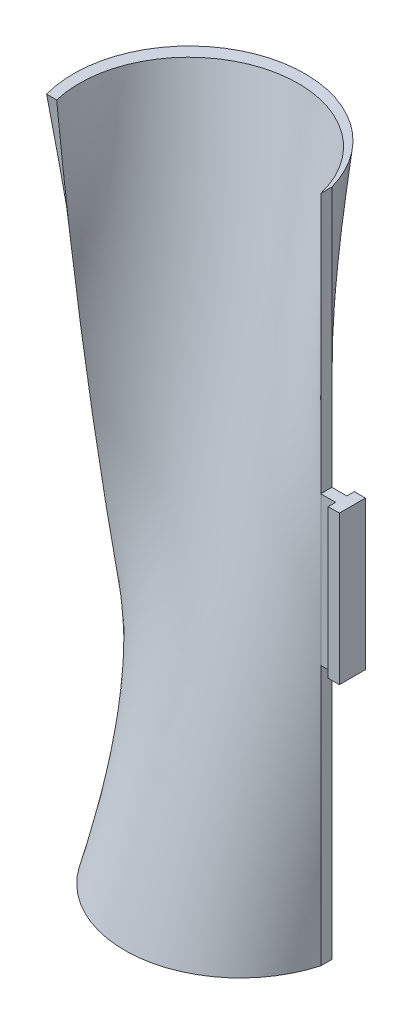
ISO-10303-21;
HEADER;
FILE_DESCRIPTION(('STEP AP214'),'2;1');
FILE_NAME('part.step','',(''),(''),'','','');
FILE_SCHEMA(('AUTOMOTIVE_DESIGN { 1 0 10303 214 1 1 1 1 }'));
ENDSEC;
DATA;
#1=APPLICATION_CONTEXT('core data for automotive mechanical design processes');
#2=APPLICATION_PROTOCOL_DEFINITION('international standard','automotive_design',2000,#1);
#3=PRODUCT_CONTEXT('',#1,'mechanical');
#4=PRODUCT('Part','Part','',(#3));
#5=PRODUCT_RELATED_PRODUCT_CATEGORY('part','',(#4));
#6=PRODUCT_DEFINITION_FORMATION('','',#4);
#7=PRODUCT_DEFINITION_CONTEXT('part definition',#1,'design');
#8=PRODUCT_DEFINITION('design','',#6,#7);
#9=PRODUCT_DEFINITION_SHAPE('','',#8);
#10=(LENGTH_UNIT() NAMED_UNIT(*) SI_UNIT(.MILLI.,.METRE.));
#11=(NAMED_UNIT(*) PLANE_ANGLE_UNIT() SI_UNIT($,.RADIAN.));
#12=(NAMED_UNIT(*) SI_UNIT($,.STERADIAN.) SOLID_ANGLE_UNIT());
#13=UNCERTAINTY_MEASURE_WITH_UNIT(LENGTH_MEASURE(1.E-05),#10,'distance_accuracy_value','');
#14=(GEOMETRIC_REPRESENTATION_CONTEXT(3) GLOBAL_UNCERTAINTY_ASSIGNED_CONTEXT((#13)) GLOBAL_UNIT_ASSIGNED_CONTEXT((#10,
#11,#12)) REPRESENTATION_CONTEXT('',''));
#15=CARTESIAN_POINT('',(0.,0.,0.));
#16=DIRECTION('',(0.,0.,1.));
#17=DIRECTION('',(1.,0.,0.));
#18=AXIS2_PLACEMENT_3D('',#15,#16,#17);
#19=CARTESIAN_POINT('',(0.,0.,-1.26868026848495));
#20=DIRECTION('',(1.,0.,0.));
#21=DIRECTION('',(0.,0.,-1.));
#22=AXIS2_PLACEMENT_3D('',#19,#20,#21);
#23=PLANE('',#22);
#24=DIRECTION('',(0.,1.,0.));
#25=VECTOR('',#24,1.);
#26=CARTESIAN_POINT('',(0.,90.,-4.26868026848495));
#27=LINE('',#26,#25);
#28=CARTESIAN_POINT('',(0.,0.,-4.26868026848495));
#29=VERTEX_POINT('',#28);
#30=CARTESIAN_POINT('',(0.,70.,-4.26868026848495));
#31=VERTEX_POINT('',#30);
#32=EDGE_CURVE('E448',#29,#31,#27,.T.);
#33=ORIENTED_EDGE('',*,*,#32,.T.);
#34=DIRECTION('',(0.,0.,1.));
#35=VECTOR('',#34,1.);
#36=CARTESIAN_POINT('',(0.,70.,-4.26868026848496));
#37=LINE('',#36,#35);
#38=CARTESIAN_POINT('',(0.,70.,-1.26868026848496));
#39=VERTEX_POINT('',#38);
#40=EDGE_CURVE('E281',#31,#39,#37,.T.);
#41=ORIENTED_EDGE('',*,*,#40,.T.);
#42=DIRECTION('',(0.,-1.,0.));
#43=VECTOR('',#42,1.);
#44=CARTESIAN_POINT('',(0.,90.,-1.26868026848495));
#45=LINE('',#44,#43);
#46=CARTESIAN_POINT('',(0.,0.,-1.26868026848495));
#47=VERTEX_POINT('',#46);
#48=EDGE_CURVE('E373',#39,#47,#45,.T.);
#49=ORIENTED_EDGE('',*,*,#48,.T.);
#50=DIRECTION('',(0.,0.,-1.));
#51=VECTOR('',#50,1.);
#52=CARTESIAN_POINT('',(0.,0.,-4.26868026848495));
#53=LINE('',#52,#51);
#54=EDGE_CURVE('E316',#47,#29,#53,.T.);
#55=ORIENTED_EDGE('',*,*,#54,.T.);
#56=EDGE_LOOP('',(#33,#41,#49,#55));
#57=FACE_BOUND('',#56,.T.);
#58=ADVANCED_FACE('F153',(#57),#23,.T.);
#59=CARTESIAN_POINT('',(-30.,180.,4.11273740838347));
#60=DIRECTION('',(0.,-1.,0.));
#61=DIRECTION('',(0.,0.,-1.));
#62=AXIS2_PLACEMENT_3D('',#59,#60,#61);
#63=PLANE('',#62);
#64=CARTESIAN_POINT('',(-30.,180.,4.11273740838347));
#65=DIRECTION('',(0.,1.,0.));
#66=DIRECTION('',(0.,0.,-1.));
#67=AXIS2_PLACEMENT_3D('',#64,#65,#66);
#68=CIRCLE('',#67,31.1488067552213);
#69=CARTESIAN_POINT('',(0.,180.,-4.26868026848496));
#70=VERTEX_POINT('',#69);
#71=CARTESIAN_POINT('',(-60.,180.,12.4941550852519));
#72=VERTEX_POINT('',#71);
#73=EDGE_CURVE('E358',#70,#72,#68,.T.);
#74=ORIENTED_EDGE('',*,*,#73,.T.);
#75=DIRECTION('',(1.,0.,0.));
#76=VECTOR('',#75,1.);
#77=CARTESIAN_POINT('',(-60.,180.,12.4941550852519));
#78=LINE('',#77,#76);
#79=CARTESIAN_POINT('',(-57.3059687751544,180.,12.4941550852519));
#80=VERTEX_POINT('',#79);
#81=EDGE_CURVE('E12',#72,#80,#78,.T.);
#82=ORIENTED_EDGE('',*,*,#81,.T.);
#83=CARTESIAN_POINT('',(-28.6529843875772,180.,5.61273740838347));
#84=DIRECTION('',(0.,-1.,0.));
#85=DIRECTION('',(0.,0.,-1.));
#86=AXIS2_PLACEMENT_3D('',#83,#84,#85);
#87=CIRCLE('',#86,29.4677352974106);
#88=CARTESIAN_POINT('',(0.,180.,-1.26868026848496));
#89=VERTEX_POINT('',#88);
#90=EDGE_CURVE('E164',#80,#89,#87,.T.);
#91=ORIENTED_EDGE('',*,*,#90,.T.);
#92=DIRECTION('',(0.,0.,-1.));
#93=VECTOR('',#92,1.);
#94=CARTESIAN_POINT('',(0.,180.,-4.26868026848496));
#95=LINE('',#94,#93);
#96=EDGE_CURVE('E431',#89,#70,#95,.T.);
#97=ORIENTED_EDGE('',*,*,#96,.T.);
#98=EDGE_LOOP('',(#74,#82,#91,#97));
#99=FACE_BOUND('',#98,.T.);
#100=ADVANCED_FACE('F155',(#99),#63,.F.);
#101=CARTESIAN_POINT('',(-28.6529843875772,0.,-11.1500979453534));
#102=DIRECTION('',(0.,-1.,0.));
#103=DIRECTION('',(0.,0.,-1.));
#104=AXIS2_PLACEMENT_3D('',#101,#102,#103);
#105=PLANE('',#104);
#106=CARTESIAN_POINT('',(-28.6529843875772,0.,-11.1500979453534));
#107=DIRECTION('',(0.,-1.,0.));
#108=DIRECTION('',(0.,0.,-1.));
#109=AXIS2_PLACEMENT_3D('',#106,#107,#108);
#110=CIRCLE('',#109,29.4677352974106);
#111=CARTESIAN_POINT('',(-57.3059687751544,0.,-18.0315156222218));
#112=VERTEX_POINT('',#111);
#113=EDGE_CURVE('E262',#29,#112,#110,.T.);
#114=ORIENTED_EDGE('',*,*,#113,.F.);
#115=ORIENTED_EDGE('',*,*,#54,.F.);
#116=CARTESIAN_POINT('',(-30.,0.,-9.65009794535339));
#117=DIRECTION('',(0.,1.,0.));
#118=DIRECTION('',(0.,0.,-1.));
#119=AXIS2_PLACEMENT_3D('',#116,#117,#118);
#120=CIRCLE('',#119,31.1488067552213);
#121=CARTESIAN_POINT('',(-60.,0.,-18.0315156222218));
#122=VERTEX_POINT('',#121);
#123=EDGE_CURVE('E374',#122,#47,#120,.T.);
#124=ORIENTED_EDGE('',*,*,#123,.F.);
#125=DIRECTION('',(-1.,0.,0.));
#126=VECTOR('',#125,1.);
#127=CARTESIAN_POINT('',(-60.,0.,-18.0315156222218));
#128=LINE('',#127,#126);
#129=EDGE_CURVE('E393',#112,#122,#128,.T.);
#130=ORIENTED_EDGE('',*,*,#129,.F.);
#131=EDGE_LOOP('',(#114,#115,#124,#130));
#132=FACE_BOUND('',#131,.T.);
#133=ADVANCED_FACE('F335',(#132),#105,.T.);
#134=DIRECTION('',(0.,0.,1.));
#135=VECTOR('',#134,1.);
#136=CARTESIAN_POINT('',(0.,110.,-4.26868026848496));
#137=LINE('',#136,#135);
#138=CARTESIAN_POINT('',(0.,110.,-4.26868026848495));
#139=VERTEX_POINT('',#138);
#140=CARTESIAN_POINT('',(0.,110.,-1.26868026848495));
#141=VERTEX_POINT('',#140);
#142=EDGE_CURVE('E172',#139,#141,#137,.T.);
#143=ORIENTED_EDGE('',*,*,#142,.F.);
#144=EDGE_CURVE('E158',#139,#70,#27,.T.);
#145=ORIENTED_EDGE('',*,*,#144,.T.);
#146=ORIENTED_EDGE('',*,*,#96,.F.);
#147=EDGE_CURVE('E322',#89,#141,#45,.T.);
#148=ORIENTED_EDGE('',*,*,#147,.T.);
#149=EDGE_LOOP('',(#143,#145,#146,#148));
#150=FACE_BOUND('',#149,.T.);
#151=ADVANCED_FACE('F324',(#150),#23,.T.);
#152=CARTESIAN_POINT('',(0.,0.,-4.26868026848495));
#153=CARTESIAN_POINT('',(0.,30.,-4.26868026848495));
#154=CARTESIAN_POINT('',(0.,90.,-4.26868026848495));
#155=CARTESIAN_POINT('',(0.,150.,-4.26868026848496));
#156=CARTESIAN_POINT('',(0.,180.,-4.26868026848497));
#157=CARTESIAN_POINT('',(-0.474744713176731,0.,-2.29192874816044));
#158=CARTESIAN_POINT('',(-0.900761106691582,30.0003584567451,-2.91835552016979));
#159=CARTESIAN_POINT('',(-1.56541709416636,89.999641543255,-4.2507450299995));
#160=CARTESIAN_POINT('',(-0.968404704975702,150.000358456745,-5.65487549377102));
#161=CARTESIAN_POINT('',(-0.578228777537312,180.,-6.3383615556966));
#162=CARTESIAN_POINT('',(-1.80304194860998,0.,1.47213898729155));
#163=CARTESIAN_POINT('',(-3.08109112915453,30.0010753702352,-0.407141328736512));
#164=CARTESIAN_POINT('',(-4.31045048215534,89.9989246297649,-4.22756329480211));
#165=CARTESIAN_POINT('',(-3.29800790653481,150.001075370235,-8.21245315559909));
#166=CARTESIAN_POINT('',(-2.12748012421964,180.,-10.2629113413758));
#167=CARTESIAN_POINT('',(-4.78920009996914,0.,6.46292654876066));
#168=CARTESIAN_POINT('',(-6.47284971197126,30.0051327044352,2.9570738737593));
#169=CARTESIAN_POINT('',(-8.29843079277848,89.9948672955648,-4.19806007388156));
#170=CARTESIAN_POINT('',(-6.93028870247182,150.005132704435,-11.635674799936));
#171=CARTESIAN_POINT('',(-5.47561005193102,180.,-15.4189281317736));
#172=CARTESIAN_POINT('',(-8.62439164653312,0.,10.7090058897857));
#173=CARTESIAN_POINT('',(-10.1994779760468,30.0096844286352,5.799116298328));
#174=CARTESIAN_POINT('',(-11.9447318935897,89.990315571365,-4.18236397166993));
#175=CARTESIAN_POINT('',(-10.9110582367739,150.009684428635,-14.5091094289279));
#176=CARTESIAN_POINT('',(-9.69169316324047,180.,-19.7553234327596));
#177=CARTESIAN_POINT('',(-12.4109531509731,0.,13.5562554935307));
#178=CARTESIAN_POINT('',(-13.4882507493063,30.0135410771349,7.69904836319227));
#179=CARTESIAN_POINT('',(-14.7980355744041,89.9864589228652,-4.17891668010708));
#180=CARTESIAN_POINT('',(-14.4156781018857,150.013541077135,-16.4159360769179));
#181=CARTESIAN_POINT('',(-13.8021027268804,180.,-22.6159741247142));
#182=CARTESIAN_POINT('',(-15.7200226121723,0.,15.3724832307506));
#183=CARTESIAN_POINT('',(-16.2155368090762,30.0164005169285,8.9045024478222));
#184=CARTESIAN_POINT('',(-16.9851050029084,89.9835994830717,-4.18236498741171));
#185=CARTESIAN_POINT('',(-17.314253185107,150.016400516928,-17.6144935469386));
#186=CARTESIAN_POINT('',(-17.3680955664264,180.,-24.4060572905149));
#187=CARTESIAN_POINT('',(-18.3251867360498,0.,16.4952253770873));
#188=CARTESIAN_POINT('',(-18.3021640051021,30.0184268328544,9.64602401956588));
#189=CARTESIAN_POINT('',(-18.5850294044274,89.981573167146,-4.1880006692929));
#190=CARTESIAN_POINT('',(-19.5277771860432,150.018426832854,-18.3447437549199));
#191=CARTESIAN_POINT('',(-20.1636069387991,180.,-25.4909138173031));
#192=CARTESIAN_POINT('',(-21.0367074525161,0.,17.3648715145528));
#193=CARTESIAN_POINT('',(-20.4249790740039,30.0203202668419,10.2157707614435));
#194=CARTESIAN_POINT('',(-20.150043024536,89.9796797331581,-4.19674611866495));
#195=CARTESIAN_POINT('',(-21.774934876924,150.020320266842,-18.8969995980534));
#196=CARTESIAN_POINT('',(-23.0616410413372,180.,-26.3042873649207));
#197=CARTESIAN_POINT('',(-23.831326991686,0.,17.9734204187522));
#198=CARTESIAN_POINT('',(-22.5763792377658,30.0220839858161,10.6085332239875));
#199=CARTESIAN_POINT('',(-21.6882900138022,89.9779160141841,-4.20854370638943));
#200=CARTESIAN_POINT('',(-24.0470407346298,150.022083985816,-19.2661668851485));
#201=CARTESIAN_POINT('',(-26.0373192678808,180.,-26.838628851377));
#202=CARTESIAN_POINT('',(-26.7033051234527,0.,18.3055694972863));
#203=CARTESIAN_POINT('',(-24.7546360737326,30.0237701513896,10.8140048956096));
#204=CARTESIAN_POINT('',(-23.2018043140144,89.9762298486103,-4.22351019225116));
#205=CARTESIAN_POINT('',(-26.3417552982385,150.02377015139,-19.4417055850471));
#206=CARTESIAN_POINT('',(-29.0839839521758,180.,-27.0779964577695));
#207=CARTESIAN_POINT('',(-30.5790546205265,0.,18.3747861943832));
#208=CARTESIAN_POINT('',(-27.6764402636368,30.0258931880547,10.835186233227));
#209=CARTESIAN_POINT('',(-25.2063246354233,89.9741068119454,-4.2474006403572));
#210=CARTESIAN_POINT('',(-29.4109104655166,150.025893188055,-19.4151060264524));
#211=CARTESIAN_POINT('',(-33.1807599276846,180.,-27.0006520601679));
#212=CARTESIAN_POINT('',(-35.5832809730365,0.,17.7042751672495));
#213=CARTESIAN_POINT('',(-31.3852853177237,30.0288581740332,10.3489892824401));
#214=CARTESIAN_POINT('',(-27.6621855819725,89.9711418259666,-4.28555845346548));
#215=CARTESIAN_POINT('',(-33.2903435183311,150.028858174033,-18.8525934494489));
#216=CARTESIAN_POINT('',(-38.4408682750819,180.,-26.098098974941));
#217=CARTESIAN_POINT('',(-40.3443233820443,0.,16.0296171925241));
#218=CARTESIAN_POINT('',(-35.0218503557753,30.0318123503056,9.18594895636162));
#219=CARTESIAN_POINT('',(-30.2078871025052,89.9681876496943,-4.33201336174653));
#220=CARTESIAN_POINT('',(-37.0623754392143,150.031812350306,-17.5966433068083));
#221=CARTESIAN_POINT('',(-43.4051109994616,180.,-24.1442712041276));
#222=CARTESIAN_POINT('',(-43.7670141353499,0.,14.2074970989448));
#223=CARTESIAN_POINT('',(-37.8091215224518,30.0336646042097,7.9322708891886));
#224=CARTESIAN_POINT('',(-32.379922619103,89.9663353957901,-4.37158899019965));
#225=CARTESIAN_POINT('',(-39.9310332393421,150.03366460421,-16.2638139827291));
#226=CARTESIAN_POINT('',(-46.9498817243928,180.,-22.0866301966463));
#227=CARTESIAN_POINT('',(-46.1746817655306,0.,12.607331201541));
#228=CARTESIAN_POINT('',(-39.8494656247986,30.0350688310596,6.83526622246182));
#229=CARTESIAN_POINT('',(-34.0650733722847,89.9649311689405,-4.4025659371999));
#230=CARTESIAN_POINT('',(-42.020387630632,150.035068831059,-15.1048554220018));
#231=CARTESIAN_POINT('',(-49.4310647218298,180.,-20.302851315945));
#232=CARTESIAN_POINT('',(-48.3882333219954,0.,10.79602911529));
#233=CARTESIAN_POINT('',(-41.8282824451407,30.0364579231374,5.59691934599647));
#234=CARTESIAN_POINT('',(-35.8181288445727,89.9635420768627,-4.43441087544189));
#235=CARTESIAN_POINT('',(-44.0354598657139,150.036457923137,-13.8028186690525));
#236=CARTESIAN_POINT('',(-51.6989996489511,180.,-18.3035777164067));
#237=CARTESIAN_POINT('',(-50.4090375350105,0.,8.78982907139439));
#238=CARTESIAN_POINT('',(-43.7459488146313,30.0379853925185,4.22817922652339));
#239=CARTESIAN_POINT('',(-37.6384758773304,89.9620146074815,-4.46696055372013));
#240=CARTESIAN_POINT('',(-45.9770994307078,150.037985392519,-12.3689791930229));
#241=CARTESIAN_POINT('',(-53.7557627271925,180.,-16.1059092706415));
#242=CARTESIAN_POINT('',(-52.2202100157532,0.,6.60645024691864));
#243=CARTESIAN_POINT('',(-45.5967467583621,30.0397056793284,2.74113885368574));
#244=CARTESIAN_POINT('',(-39.5319220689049,89.960294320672,-4.4999421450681));
#245=CARTESIAN_POINT('',(-47.8394091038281,150.039705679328,-10.8159756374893));
#246=CARTESIAN_POINT('',(-55.5842062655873,179.999999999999,-13.7292188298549));
#247=CARTESIAN_POINT('',(-54.3435018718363,0.,3.48562671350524));
#248=CARTESIAN_POINT('',(-47.9718992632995,30.0423808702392,0.618752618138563));
#249=CARTESIAN_POINT('',(-42.157276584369,89.9576191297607,-4.54419023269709));
#250=CARTESIAN_POINT('',(-50.2135475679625,150.04238087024,-8.60509322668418));
#251=CARTESIAN_POINT('',(-57.705959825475,180.000000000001,-10.3501561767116));
#252=CARTESIAN_POINT('',(-56.4241203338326,0.,-0.770808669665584));
#253=CARTESIAN_POINT('',(-50.7536754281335,30.0466399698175,-2.27044092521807));
#254=CARTESIAN_POINT('',(-45.641553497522,89.9533600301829,-4.599429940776));
#255=CARTESIAN_POINT('',(-52.9632175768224,150.046639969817,-5.60542026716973));
#256=CARTESIAN_POINT('',(-59.7385504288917,179.999999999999,-5.77316387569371));
#257=CARTESIAN_POINT('',(-57.9126866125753,0.,-6.29540801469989));
#258=CARTESIAN_POINT('',(-53.7848406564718,30.0537883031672,-6.01173989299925));
#259=CARTESIAN_POINT('',(-50.1537445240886,89.9462116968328,-4.66437850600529));
#260=CARTESIAN_POINT('',(-55.907670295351,150.053788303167,-1.73422416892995));
#261=CARTESIAN_POINT('',(-61.0965043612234,180.,0.120450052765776));
#262=CARTESIAN_POINT('',(-58.3066894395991,0.,-12.0980179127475));
#263=CARTESIAN_POINT('',(-56.4014634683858,30.0630935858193,-9.93312397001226));
#264=CARTESIAN_POINT('',(-55.1054829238,89.9369064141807,-4.72480783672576));
#265=CARTESIAN_POINT('',(-58.3875706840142,150.063093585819,2.308018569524));
#266=CARTESIAN_POINT('',(-61.2874402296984,180.,6.26524416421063));
#267=CARTESIAN_POINT('',(-57.7807134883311,0.,-16.0547641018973));
#268=CARTESIAN_POINT('',(-58.0444056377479,30.0716140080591,-12.5994800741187));
#269=CARTESIAN_POINT('',(-58.5219474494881,89.9283859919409,-4.76540496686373));
#270=CARTESIAN_POINT('',(-59.9116994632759,150.071614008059,5.05556893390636));
#271=CARTESIAN_POINT('',(-60.5782287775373,180.,10.4244737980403));
#272=CARTESIAN_POINT('',(-57.3059687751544,0.,-18.0315156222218));
#273=CARTESIAN_POINT('',(-58.6541199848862,30.075874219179,-13.9310365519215));
#274=CARTESIAN_POINT('',(-60.4478696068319,89.924125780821,-4.7815475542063));
#275=CARTESIAN_POINT('',(-60.45014080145,150.075874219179,6.41941058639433));
#276=CARTESIAN_POINT('',(-60.,180.,12.4941550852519));
#277=B_SPLINE_SURFACE_WITH_KNOTS('',3,3,((#152,#153,#154,#155,#156),(#157,#158,#159,#160,#161),
(#162,#163,#164,#165,#166),(#167,#168,#169,#170,#171),(#172,#173,#174,#175,#176),(#177,#178,
#179,#180,#181),(#182,#183,#184,#185,#186),(#187,#188,#189,#190,#191),(#192,#193,#194,#195,
#196),(#197,#198,#199,#200,#201),(#202,#203,#204,#205,#206),(#207,#208,#209,#210,#211),(#212,
#213,#214,#215,#216),(#217,#218,#219,#220,#221),(#222,#223,#224,#225,#226),(#227,#228,#229,#230,
#231),(#232,#233,#234,#235,#236),(#237,#238,#239,#240,#241),(#242,#243,#244,#245,#246),(#247,
#248,#249,#250,#251),(#252,#253,#254,#255,#256),(#257,#258,#259,#260,#261),(#262,#263,#264,#265,
#266),(#267,#268,#269,#270,#271),(#272,#273,#274,#275,#276)),.UNSPECIFIED.,.F.,.F.,.F.,(4,1,1,1,
1,1,1,1,1,1,1,1,1,1,1,1,1,1,1,1,1,1,4),(4,1,4),(0.,0.0625,0.125,0.1875,0.25,0.28125,0.3125,
0.34375,0.375,0.40625,0.4375,0.5,0.5625,0.59375,0.625,0.65625,0.6875,0.71875,0.75,0.8125,0.875,
0.9375,1.),(0.,0.5,1.),.UNSPECIFIED.);
#278=CARTESIAN_POINT('',(-57.3059687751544,0.,-18.0315156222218));
#279=CARTESIAN_POINT('',(-58.6541199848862,30.075874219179,-13.9310365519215));
#280=CARTESIAN_POINT('',(-60.4478696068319,89.924125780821,-4.7815475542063));
#281=CARTESIAN_POINT('',(-60.45014080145,150.075874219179,6.41941058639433));
#282=CARTESIAN_POINT('',(-60.,180.,12.4941550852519));
#283=B_SPLINE_CURVE_WITH_KNOTS('',3,(#278,#279,#280,#281,#282),.UNSPECIFIED.,.F.,.F.,(4,1,4),
(0.,0.5,1.),.UNSPECIFIED.);
#284=EDGE_CURVE('E451',#112,#72,#283,.T.);
#285=DIRECTION('',(0.,-1.,0.));
#286=VECTOR('',#285,1.);
#287=CARTESIAN_POINT('',(0.,110.,-4.26868026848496));
#288=LINE('',#287,#286);
#289=EDGE_CURVE('E179',#139,#31,#288,.T.);
#290=ORIENTED_EDGE('',*,*,#113,.T.);
#291=ORIENTED_EDGE('',*,*,#284,.T.);
#292=ORIENTED_EDGE('',*,*,#73,.F.);
#293=ORIENTED_EDGE('',*,*,#144,.F.);
#294=ORIENTED_EDGE('',*,*,#289,.T.);
#295=ORIENTED_EDGE('',*,*,#32,.F.);
#296=EDGE_LOOP('',(#290,#291,#292,#293,#294,#295));
#297=FACE_BOUND('',#296,.T.);
#298=ADVANCED_FACE('F334',(#297),#277,.T.);
#299=CARTESIAN_POINT('',(-60.,0.,-18.0315156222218));
#300=CARTESIAN_POINT('',(-60.45014080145,29.924125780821,-11.9567711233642));
#301=CARTESIAN_POINT('',(-60.4478696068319,90.0758742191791,-0.755812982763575));
#302=CARTESIAN_POINT('',(-58.6541199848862,149.924125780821,8.3936760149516));
#303=CARTESIAN_POINT('',(-57.3059687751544,180.,12.4941550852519));
#304=CARTESIAN_POINT('',(-60.5782287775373,0.,-15.9618343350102));
#305=CARTESIAN_POINT('',(-59.9117010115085,29.928386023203,-10.5929307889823));
#306=CARTESIAN_POINT('',(-58.5219459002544,90.0716139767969,-0.771955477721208));
#307=CARTESIAN_POINT('',(-58.0444071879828,149.928386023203,7.06212067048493));
#308=CARTESIAN_POINT('',(-57.7807134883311,180.,10.5174035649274));
#309=CARTESIAN_POINT('',(-61.2874321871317,0.,-11.8025914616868));
#310=CARTESIAN_POINT('',(-58.3875672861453,29.9369065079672,-7.84536982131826));
#311=CARTESIAN_POINT('',(-55.1054863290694,90.0630934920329,-0.812552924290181));
#312=CARTESIAN_POINT('',(-56.4014600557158,149.936906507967,4.39575459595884));
#313=CARTESIAN_POINT('',(-58.3066813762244,180.,6.56064513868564));
#314=CARTESIAN_POINT('',(-61.0965190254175,0.,-5.65783472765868));
#315=CARTESIAN_POINT('',(-55.9076753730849,29.9462115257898,-3.80315233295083));
#316=CARTESIAN_POINT('',(-50.153739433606,90.0537884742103,-0.872981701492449));
#317=CARTESIAN_POINT('',(-53.784845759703,149.94621152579,0.474394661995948));
#318=CARTESIAN_POINT('',(-57.9127013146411,180.,0.758069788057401));
#319=CARTESIAN_POINT('',(-59.7385218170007,0.,0.235850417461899));
#320=CARTESIAN_POINT('',(-52.9632079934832,29.9533603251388,0.0680905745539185));
#321=CARTESIAN_POINT('',(-45.6415631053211,90.0466396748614,-0.937931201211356));
#322=CARTESIAN_POINT('',(-50.7536657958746,149.953360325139,-3.26694924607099));
#323=CARTESIAN_POINT('',(-56.4240916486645,180.,-4.76659538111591));
#324=CARTESIAN_POINT('',(-57.7060094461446,0.,4.8127142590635));
#325=CARTESIAN_POINT('',(-50.213564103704,29.9576186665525,3.06767946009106));
#326=CARTESIAN_POINT('',(-42.1572600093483,90.0423813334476,-0.993169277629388));
#327=CARTESIAN_POINT('',(-47.9719158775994,149.957618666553,-6.15606197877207));
#328=CARTESIAN_POINT('',(-54.3435516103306,180.,-9.02291203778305));
#329=CARTESIAN_POINT('',(-55.584198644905,0.,8.19185935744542));
#330=CARTESIAN_POINT('',(-47.8394064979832,29.9602943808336,5.27861575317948));
#331=CARTESIAN_POINT('',(-39.5319245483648,90.0397056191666,-1.03741844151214));
#332=CARTESIAN_POINT('',(-45.5967444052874,149.960294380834,-8.27849994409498));
#333=CARTESIAN_POINT('',(-52.2202027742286,180.,-12.1438115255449));
#334=CARTESIAN_POINT('',(-53.7557771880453,0.,10.5685529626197));
#335=CARTESIAN_POINT('',(-45.9771044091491,29.962014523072,6.83162153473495));
#336=CARTESIAN_POINT('',(-37.638471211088,90.0379854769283,-1.07039995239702));
#337=CARTESIAN_POINT('',(-43.7459531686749,149.962014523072,-9.7655427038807));
#338=CARTESIAN_POINT('',(-50.4090510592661,180.,-14.327194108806));
#339=CARTESIAN_POINT('',(-51.698967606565,0.,12.7662136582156));
#340=CARTESIAN_POINT('',(-44.0354488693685,29.9635422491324,8.26545559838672));
#341=CARTESIAN_POINT('',(-35.818139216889,90.0364577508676,-1.1029497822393));
#342=CARTESIAN_POINT('',(-41.8282726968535,149.963542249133,-11.1342771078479));
#343=CARTESIAN_POINT('',(-48.3882031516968,180.,-16.333385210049));
#344=CARTESIAN_POINT('',(-49.431133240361,0.,14.7654907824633));
#345=CARTESIAN_POINT('',(-42.0204111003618,29.9649308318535,9.56749535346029));
#346=CARTESIAN_POINT('',(-34.0650511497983,90.0350691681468,-1.13479427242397));
#347=CARTESIAN_POINT('',(-39.8494866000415,149.964930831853,-12.3726278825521));
#348=CARTESIAN_POINT('',(-46.1747465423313,179.999999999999,-18.1446941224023));
#349=CARTESIAN_POINT('',(-46.9497049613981,0.,16.549300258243));
#350=CARTESIAN_POINT('',(-39.9309728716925,29.9663361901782,10.7264723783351));
#351=CARTESIAN_POINT('',(-32.3799801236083,90.0336638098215,-1.16577268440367));
#352=CARTESIAN_POINT('',(-37.8090668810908,149.966336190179,-13.4696480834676));
#353=CARTESIAN_POINT('',(-43.766845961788,180.000000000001,-19.7448804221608));
#354=CARTESIAN_POINT('',(-43.4060726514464,0.,18.6065376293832));
#355=CARTESIAN_POINT('',(-37.0627026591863,29.968183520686,12.0590438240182));
#356=CARTESIAN_POINT('',(-30.2075730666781,90.0318164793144,-1.20533899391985));
#357=CARTESIAN_POINT('',(-35.0221512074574,149.968183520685,-14.7230869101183));
#358=CARTESIAN_POINT('',(-40.3452454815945,179.999999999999,-21.5666584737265));
#359=CARTESIAN_POINT('',(-38.4398534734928,0.,20.5610219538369));
#360=CARTESIAN_POINT('',(-33.2899975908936,29.9711455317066,13.3154126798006));
#361=CARTESIAN_POINT('',(-27.6625163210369,90.0288544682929,-1.25180975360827));
#362=CARTESIAN_POINT('',(-31.3849697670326,149.971145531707,-15.8865142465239));
#363=CARTESIAN_POINT('',(-35.5823117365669,180.000000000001,-23.2418684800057));
#364=CARTESIAN_POINT('',(-33.1817756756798,0.,21.463112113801));
#365=CARTESIAN_POINT('',(-29.4112573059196,29.974103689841,13.8776341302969));
#366=CARTESIAN_POINT('',(-25.2059942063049,90.025896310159,-1.28995311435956));
#367=CARTESIAN_POINT('',(-27.6767542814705,149.974103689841,-16.3724489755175));
#368=CARTESIAN_POINT('',(-30.5800211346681,180.,-23.9120124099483));
#369=CARTESIAN_POINT('',(-29.0838169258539,0.,21.5407013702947));
#370=CARTESIAN_POINT('',(-26.3416984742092,29.9762302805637,13.9043870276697));
#371=CARTESIAN_POINT('',(-23.2018588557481,90.0237697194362,-1.31385181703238));
#372=CARTESIAN_POINT('',(-24.7545838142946,149.976230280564,-16.3514044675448));
#373=CARTESIAN_POINT('',(-26.7031449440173,180.,-23.8429861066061));
#374=CARTESIAN_POINT('',(-26.0373778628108,0.,21.3012327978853));
#375=CARTESIAN_POINT('',(-24.0470605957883,29.977915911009,13.7287833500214));
#376=CARTESIAN_POINT('',(-21.6882708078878,90.022084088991,-1.32881618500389));
#377=CARTESIAN_POINT('',(-22.5763977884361,149.977915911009,-16.1458720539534));
#378=CARTESIAN_POINT('',(-23.831383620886,180.,-23.5107494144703));
#379=CARTESIAN_POINT('',(-23.0616154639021,0.,20.7669464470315));
#380=CARTESIAN_POINT('',(-21.7749262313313,29.9796797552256,13.3596518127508));
#381=CARTESIAN_POINT('',(-20.1500514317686,90.0203202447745,-1.34061474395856));
#382=CARTESIAN_POINT('',(-20.4249709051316,149.979679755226,-15.7531433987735));
#383=CARTESIAN_POINT('',(-21.0366825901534,180.,-22.9022497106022));
#384=CARTESIAN_POINT('',(-20.1636171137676,0.,19.9535421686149));
#385=CARTESIAN_POINT('',(-19.5277806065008,29.9815731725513,12.8073759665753));
#386=CARTESIAN_POINT('',(-18.5850260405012,90.0184268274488,-1.34935970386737));
#387=CARTESIAN_POINT('',(-18.3021673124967,149.981573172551,-15.1833776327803));
#388=CARTESIAN_POINT('',(-18.3251967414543,180.,-22.0325757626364));
#389=CARTESIAN_POINT('',(-17.3680884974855,0.,18.8686997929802));
#390=CARTESIAN_POINT('',(-17.3142507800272,29.9835994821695,12.0771349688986));
#391=CARTESIAN_POINT('',(-16.9851073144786,90.0164005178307,-1.3549956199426));
#392=CARTESIAN_POINT('',(-16.2155345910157,149.983599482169,-14.4418648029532));
#393=CARTESIAN_POINT('',(-15.7200158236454,180.,-20.9098463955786));
#394=CARTESIAN_POINT('',(-13.8021873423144,0.,17.0786574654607));
#395=CARTESIAN_POINT('',(-14.4157073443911,29.9864587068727,10.8786049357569));
#396=CARTESIAN_POINT('',(-14.7980083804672,90.0135412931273,-1.35844381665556));
#397=CARTESIAN_POINT('',(-13.4882758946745,149.986458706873,-13.2364383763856));
#398=CARTESIAN_POINT('',(-12.4110316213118,180.,-19.0936604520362));
#399=CARTESIAN_POINT('',(-9.69164429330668,0.,14.2179374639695));
#400=CARTESIAN_POINT('',(-10.9110412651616,29.9903156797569,8.9717318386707));
#401=CARTESIAN_POINT('',(-11.9447476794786,90.0096843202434,-1.35499659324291));
#402=CARTESIAN_POINT('',(-10.1994633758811,149.990315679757,-11.3364597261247));
#403=CARTESIAN_POINT('',(-8.62434632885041,180.,-16.2463406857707));
#404=CARTESIAN_POINT('',(-5.47563510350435,0.,9.88158063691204));
#405=CARTESIAN_POINT('',(-6.93029768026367,29.994867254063,6.0983230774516));
#406=CARTESIAN_POINT('',(-8.29842242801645,90.0051327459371,-1.33930044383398));
#407=CARTESIAN_POINT('',(-6.47285746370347,149.994867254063,-8.49444326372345));
#408=CARTESIAN_POINT('',(-4.78922333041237,180.,-12.0003002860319));
#409=CARTESIAN_POINT('',(-2.12746638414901,0.,4.72554365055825));
#410=CARTESIAN_POINT('',(-3.29800195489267,29.998924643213,2.67508751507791));
#411=CARTESIAN_POINT('',(-4.31045607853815,90.001075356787,-1.30979725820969));
#412=CARTESIAN_POINT('',(-3.08108588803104,149.998924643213,-5.13021407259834));
#413=CARTESIAN_POINT('',(-1.80302920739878,180.,-7.00949228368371));
#414=CARTESIAN_POINT('',(-0.578228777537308,0.,0.801001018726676));
#415=CARTESIAN_POINT('',(-0.968407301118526,29.9996415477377,0.117515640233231));
#416=CARTESIAN_POINT('',(-1.56541454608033,90.0003584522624,-1.28661549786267));
#417=CARTESIAN_POINT('',(-0.900763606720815,149.999641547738,-2.61900571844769));
#418=CARTESIAN_POINT('',(-0.474744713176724,180.,-3.24543178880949));
#419=CARTESIAN_POINT('',(0.,0.,-1.26868026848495));
#420=CARTESIAN_POINT('',(0.,30.,-1.26868026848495));
#421=CARTESIAN_POINT('',(0.,90.,-1.26868026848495));
#422=CARTESIAN_POINT('',(0.,150.,-1.26868026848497));
#423=CARTESIAN_POINT('',(0.,180.,-1.26868026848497));
#424=B_SPLINE_SURFACE_WITH_KNOTS('',3,3,((#299,#300,#301,#302,#303),(#304,#305,#306,#307,#308),
(#309,#310,#311,#312,#313),(#314,#315,#316,#317,#318),(#319,#320,#321,#322,#323),(#324,#325,
#326,#327,#328),(#329,#330,#331,#332,#333),(#334,#335,#336,#337,#338),(#339,#340,#341,#342,
#343),(#344,#345,#346,#347,#348),(#349,#350,#351,#352,#353),(#354,#355,#356,#357,#358),(#359,
#360,#361,#362,#363),(#364,#365,#366,#367,#368),(#369,#370,#371,#372,#373),(#374,#375,#376,#377,
#378),(#379,#380,#381,#382,#383),(#384,#385,#386,#387,#388),(#389,#390,#391,#392,#393),(#394,
#395,#396,#397,#398),(#399,#400,#401,#402,#403),(#404,#405,#406,#407,#408),(#409,#410,#411,#412,
#413),(#414,#415,#416,#417,#418),(#419,#420,#421,#422,#423)),.UNSPECIFIED.,.F.,.F.,.F.,(4,1,1,1,
1,1,1,1,1,1,1,1,1,1,1,1,1,1,1,1,1,1,4),(4,1,4),(0.,0.0625,0.125,0.1875,0.25,0.28125,0.3125,
0.34375,0.375,0.40625,0.4375,0.5,0.5625,0.59375,0.625,0.65625,0.6875,0.71875,0.75,0.8125,0.875,
0.9375,1.),(0.,0.5,1.),.UNSPECIFIED.);
#425=EDGE_CURVE('E440',#141,#39,#45,.T.);
#426=CARTESIAN_POINT('',(-60.,0.,-18.0315156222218));
#427=CARTESIAN_POINT('',(-60.45014080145,29.924125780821,-11.9567711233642));
#428=CARTESIAN_POINT('',(-60.4478696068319,90.0758742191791,-0.755812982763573));
#429=CARTESIAN_POINT('',(-58.6541199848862,149.924125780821,8.3936760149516));
#430=CARTESIAN_POINT('',(-57.3059687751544,180.,12.4941550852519));
#431=B_SPLINE_CURVE_WITH_KNOTS('',3,(#426,#427,#428,#429,#430),.UNSPECIFIED.,.F.,.F.,(4,1,4),
(0.,0.5,1.),.UNSPECIFIED.);
#432=EDGE_CURVE('E466',#122,#80,#431,.T.);
#433=ORIENTED_EDGE('',*,*,#123,.T.);
#434=ORIENTED_EDGE('',*,*,#48,.F.);
#435=ORIENTED_EDGE('',*,*,#425,.F.);
#436=ORIENTED_EDGE('',*,*,#147,.F.);
#437=ORIENTED_EDGE('',*,*,#90,.F.);
#438=ORIENTED_EDGE('',*,*,#432,.F.);
#439=EDGE_LOOP('',(#433,#434,#435,#436,#437,#438));
#440=FACE_BOUND('',#439,.T.);
#441=ADVANCED_FACE('F492',(#440),#424,.T.);
#442=CARTESIAN_POINT('',(-57.3059687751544,0.,-18.0315156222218));
#443=CARTESIAN_POINT('',(-58.6541199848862,30.075874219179,-13.9310365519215));
#444=CARTESIAN_POINT('',(-60.4478696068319,89.924125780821,-4.78154755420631));
#445=CARTESIAN_POINT('',(-60.45014080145,150.075874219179,6.41941058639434));
#446=CARTESIAN_POINT('',(-60.,180.,12.4941550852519));
#447=CARTESIAN_POINT('',(-58.2039791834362,0.,-18.0315156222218));
#448=CARTESIAN_POINT('',(-59.2527935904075,30.025291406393,-13.2729480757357));
#449=CARTESIAN_POINT('',(-60.4478696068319,89.974708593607,-3.43963603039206));
#450=CARTESIAN_POINT('',(-59.8514671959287,150.025291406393,7.07749906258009));
#451=CARTESIAN_POINT('',(-59.1019895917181,180.,12.4941550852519));
#452=CARTESIAN_POINT('',(-59.1019895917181,0.,-18.0315156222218));
#453=CARTESIAN_POINT('',(-59.8514671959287,29.974708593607,-12.61485959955));
#454=CARTESIAN_POINT('',(-60.4478696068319,90.0252914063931,-2.09772450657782));
#455=CARTESIAN_POINT('',(-59.2527935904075,149.974708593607,7.73558753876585));
#456=CARTESIAN_POINT('',(-58.2039791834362,180.,12.4941550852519));
#457=CARTESIAN_POINT('',(-60.,0.,-18.0315156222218));
#458=CARTESIAN_POINT('',(-60.45014080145,29.924125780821,-11.9567711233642));
#459=CARTESIAN_POINT('',(-60.4478696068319,90.0758742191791,-0.755812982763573));
#460=CARTESIAN_POINT('',(-58.6541199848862,149.924125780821,8.3936760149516));
#461=CARTESIAN_POINT('',(-57.3059687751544,180.,12.4941550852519));
#462=B_SPLINE_SURFACE_WITH_KNOTS('',3,3,((#442,#443,#444,#445,#446),(#447,#448,#449,#450,#451),
(#452,#453,#454,#455,#456),(#457,#458,#459,#460,#461)),.UNSPECIFIED.,.F.,.F.,.F.,(4,4),(4,1,4),
(0.,1.),(0.,0.5,1.),.UNSPECIFIED.);
#463=ORIENTED_EDGE('',*,*,#129,.T.);
#464=ORIENTED_EDGE('',*,*,#432,.T.);
#465=ORIENTED_EDGE('',*,*,#81,.F.);
#466=ORIENTED_EDGE('',*,*,#284,.F.);
#467=EDGE_LOOP('',(#463,#464,#465,#466));
#468=FACE_BOUND('',#467,.T.);
#469=ADVANCED_FACE('F482',(#468),#462,.T.);
#470=CARTESIAN_POINT('',(0.,110.,-1.26868026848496));
#471=DIRECTION('',(0.,0.,-1.));
#472=DIRECTION('',(-1.,0.,0.));
#473=AXIS2_PLACEMENT_3D('',#470,#471,#472);
#474=PLANE('',#473);
#475=DIRECTION('',(1.,0.,0.));
#476=VECTOR('',#475,1.);
#477=CARTESIAN_POINT('',(0.,70.,-1.26868026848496));
#478=LINE('',#477,#476);
#479=CARTESIAN_POINT('',(4.,70.,-1.26868026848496));
#480=VERTEX_POINT('',#479);
#481=EDGE_CURVE('E259',#39,#480,#478,.T.);
#482=ORIENTED_EDGE('',*,*,#481,.T.);
#483=DIRECTION('',(0.,-1.,0.));
#484=VECTOR('',#483,1.);
#485=CARTESIAN_POINT('',(4.,110.,-1.26868026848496));
#486=LINE('',#485,#484);
#487=CARTESIAN_POINT('',(4.,110.,-1.26868026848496));
#488=VERTEX_POINT('',#487);
#489=EDGE_CURVE('E256',#488,#480,#486,.T.);
#490=ORIENTED_EDGE('',*,*,#489,.F.);
#491=DIRECTION('',(1.,0.,0.));
#492=VECTOR('',#491,1.);
#493=CARTESIAN_POINT('',(0.,110.,-1.26868026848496));
#494=LINE('',#493,#492);
#495=EDGE_CURVE('E245',#141,#488,#494,.T.);
#496=ORIENTED_EDGE('',*,*,#495,.F.);
#497=ORIENTED_EDGE('',*,*,#425,.T.);
#498=EDGE_LOOP('',(#482,#490,#496,#497));
#499=FACE_BOUND('',#498,.T.);
#500=ADVANCED_FACE('F257',(#499),#474,.F.);
#501=CARTESIAN_POINT('',(4.,110.,-1.26868026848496));
#502=DIRECTION('',(1.,0.,0.));
#503=DIRECTION('',(0.,0.,-1.));
#504=AXIS2_PLACEMENT_3D('',#501,#502,#503);
#505=PLANE('',#504);
#506=DIRECTION('',(0.,0.,1.));
#507=VECTOR('',#506,1.);
#508=CARTESIAN_POINT('',(4.,70.,-1.26868026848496));
#509=LINE('',#508,#507);
#510=CARTESIAN_POINT('',(4.,70.,0.73131973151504));
#511=VERTEX_POINT('',#510);
#512=EDGE_CURVE('E285',#480,#511,#509,.T.);
#513=ORIENTED_EDGE('',*,*,#512,.T.);
#514=DIRECTION('',(0.,-1.,0.));
#515=VECTOR('',#514,1.);
#516=CARTESIAN_POINT('',(4.,110.,0.73131973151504));
#517=LINE('',#516,#515);
#518=CARTESIAN_POINT('',(4.,110.,0.73131973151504));
#519=VERTEX_POINT('',#518);
#520=EDGE_CURVE('E263',#519,#511,#517,.T.);
#521=ORIENTED_EDGE('',*,*,#520,.F.);
#522=DIRECTION('',(0.,0.,1.));
#523=VECTOR('',#522,1.);
#524=CARTESIAN_POINT('',(4.,110.,-1.26868026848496));
#525=LINE('',#524,#523);
#526=EDGE_CURVE('E249',#488,#519,#525,.T.);
#527=ORIENTED_EDGE('',*,*,#526,.F.);
#528=ORIENTED_EDGE('',*,*,#489,.T.);
#529=EDGE_LOOP('',(#513,#521,#527,#528));
#530=FACE_BOUND('',#529,.T.);
#531=ADVANCED_FACE('F265',(#530),#505,.F.);
#532=CARTESIAN_POINT('',(4.,110.,0.73131973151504));
#533=DIRECTION('',(0.,0.,-1.));
#534=DIRECTION('',(-1.,0.,0.));
#535=AXIS2_PLACEMENT_3D('',#532,#533,#534);
#536=PLANE('',#535);
#537=DIRECTION('',(1.,0.,0.));
#538=VECTOR('',#537,1.);
#539=CARTESIAN_POINT('',(4.,70.,0.73131973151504));
#540=LINE('',#539,#538);
#541=CARTESIAN_POINT('',(7.,70.,0.73131973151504));
#542=VERTEX_POINT('',#541);
#543=EDGE_CURVE('E287',#511,#542,#540,.T.);
#544=ORIENTED_EDGE('',*,*,#543,.T.);
#545=DIRECTION('',(0.,-1.,0.));
#546=VECTOR('',#545,1.);
#547=CARTESIAN_POINT('',(7.,110.,0.73131973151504));
#548=LINE('',#547,#546);
#549=CARTESIAN_POINT('',(7.,110.,0.73131973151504));
#550=VERTEX_POINT('',#549);
#551=EDGE_CURVE('E308',#550,#542,#548,.T.);
#552=ORIENTED_EDGE('',*,*,#551,.F.);
#553=DIRECTION('',(1.,0.,0.));
#554=VECTOR('',#553,1.);
#555=CARTESIAN_POINT('',(4.,110.,0.73131973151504));
#556=LINE('',#555,#554);
#557=EDGE_CURVE('E268',#519,#550,#556,.T.);
#558=ORIENTED_EDGE('',*,*,#557,.F.);
#559=ORIENTED_EDGE('',*,*,#520,.T.);
#560=EDGE_LOOP('',(#544,#552,#558,#559));
#561=FACE_BOUND('',#560,.T.);
#562=ADVANCED_FACE('F551',(#561),#536,.F.);
#563=CARTESIAN_POINT('',(7.,110.,-6.26868026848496));
#564=DIRECTION('',(-1.,0.,0.));
#565=DIRECTION('',(0.,0.,1.));
#566=AXIS2_PLACEMENT_3D('',#563,#564,#565);
#567=PLANE('',#566);
#568=DIRECTION('',(0.,0.,-1.));
#569=VECTOR('',#568,1.);
#570=CARTESIAN_POINT('',(7.,70.,-6.26868026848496));
#571=LINE('',#570,#569);
#572=CARTESIAN_POINT('',(7.,70.,-6.26868026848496));
#573=VERTEX_POINT('',#572);
#574=EDGE_CURVE('E289',#542,#573,#571,.T.);
#575=ORIENTED_EDGE('',*,*,#574,.T.);
#576=DIRECTION('',(0.,-1.,0.));
#577=VECTOR('',#576,1.);
#578=CARTESIAN_POINT('',(7.,110.,-6.26868026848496));
#579=LINE('',#578,#577);
#580=CARTESIAN_POINT('',(7.,110.,-6.26868026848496));
#581=VERTEX_POINT('',#580);
#582=EDGE_CURVE('E305',#581,#573,#579,.T.);
#583=ORIENTED_EDGE('',*,*,#582,.F.);
#584=DIRECTION('',(0.,0.,-1.));
#585=VECTOR('',#584,1.);
#586=CARTESIAN_POINT('',(7.,110.,-6.26868026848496));
#587=LINE('',#586,#585);
#588=EDGE_CURVE('E270',#550,#581,#587,.T.);
#589=ORIENTED_EDGE('',*,*,#588,.F.);
#590=ORIENTED_EDGE('',*,*,#551,.T.);
#591=EDGE_LOOP('',(#575,#583,#589,#590));
#592=FACE_BOUND('',#591,.T.);
#593=ADVANCED_FACE('F558',(#592),#567,.F.);
#594=CARTESIAN_POINT('',(4.,110.,-6.26868026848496));
#595=DIRECTION('',(0.,0.,1.));
#596=DIRECTION('',(1.,0.,0.));
#597=AXIS2_PLACEMENT_3D('',#594,#595,#596);
#598=PLANE('',#597);
#599=DIRECTION('',(-1.,0.,0.));
#600=VECTOR('',#599,1.);
#601=CARTESIAN_POINT('',(4.,70.,-6.26868026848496));
#602=LINE('',#601,#600);
#603=CARTESIAN_POINT('',(4.,70.,-6.26868026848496));
#604=VERTEX_POINT('',#603);
#605=EDGE_CURVE('E291',#573,#604,#602,.T.);
#606=ORIENTED_EDGE('',*,*,#605,.T.);
#607=DIRECTION('',(0.,-1.,0.));
#608=VECTOR('',#607,1.);
#609=CARTESIAN_POINT('',(4.,110.,-6.26868026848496));
#610=LINE('',#609,#608);
#611=CARTESIAN_POINT('',(4.,110.,-6.26868026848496));
#612=VERTEX_POINT('',#611);
#613=EDGE_CURVE('E302',#612,#604,#610,.T.);
#614=ORIENTED_EDGE('',*,*,#613,.F.);
#615=DIRECTION('',(-1.,0.,0.));
#616=VECTOR('',#615,1.);
#617=CARTESIAN_POINT('',(4.,110.,-6.26868026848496));
#618=LINE('',#617,#616);
#619=EDGE_CURVE('E275',#581,#612,#618,.T.);
#620=ORIENTED_EDGE('',*,*,#619,.F.);
#621=ORIENTED_EDGE('',*,*,#582,.T.);
#622=EDGE_LOOP('',(#606,#614,#620,#621));
#623=FACE_BOUND('',#622,.T.);
#624=ADVANCED_FACE('F561',(#623),#598,.F.);
#625=CARTESIAN_POINT('',(4.,110.,-6.26868026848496));
#626=DIRECTION('',(1.,0.,0.));
#627=DIRECTION('',(0.,0.,-1.));
#628=AXIS2_PLACEMENT_3D('',#625,#626,#627);
#629=PLANE('',#628);
#630=DIRECTION('',(0.,0.,1.));
#631=VECTOR('',#630,1.);
#632=CARTESIAN_POINT('',(4.,70.,-6.26868026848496));
#633=LINE('',#632,#631);
#634=CARTESIAN_POINT('',(4.,70.,-4.26868026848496));
#635=VERTEX_POINT('',#634);
#636=EDGE_CURVE('E293',#604,#635,#633,.T.);
#637=ORIENTED_EDGE('',*,*,#636,.T.);
#638=DIRECTION('',(0.,-1.,0.));
#639=VECTOR('',#638,1.);
#640=CARTESIAN_POINT('',(4.,110.,-4.26868026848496));
#641=LINE('',#640,#639);
#642=CARTESIAN_POINT('',(4.,110.,-4.26868026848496));
#643=VERTEX_POINT('',#642);
#644=EDGE_CURVE('E299',#643,#635,#641,.T.);
#645=ORIENTED_EDGE('',*,*,#644,.F.);
#646=DIRECTION('',(0.,0.,1.));
#647=VECTOR('',#646,1.);
#648=CARTESIAN_POINT('',(4.,110.,-6.26868026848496));
#649=LINE('',#648,#647);
#650=EDGE_CURVE('E277',#612,#643,#649,.T.);
#651=ORIENTED_EDGE('',*,*,#650,.F.);
#652=ORIENTED_EDGE('',*,*,#613,.T.);
#653=EDGE_LOOP('',(#637,#645,#651,#652));
#654=FACE_BOUND('',#653,.T.);
#655=ADVANCED_FACE('F564',(#654),#629,.F.);
#656=CARTESIAN_POINT('',(0.,110.,-4.26868026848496));
#657=DIRECTION('',(0.,0.,1.));
#658=DIRECTION('',(1.,0.,0.));
#659=AXIS2_PLACEMENT_3D('',#656,#657,#658);
#660=PLANE('',#659);
#661=DIRECTION('',(-1.,0.,0.));
#662=VECTOR('',#661,1.);
#663=CARTESIAN_POINT('',(0.,70.,-4.26868026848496));
#664=LINE('',#663,#662);
#665=EDGE_CURVE('E295',#635,#31,#664,.T.);
#666=ORIENTED_EDGE('',*,*,#665,.T.);
#667=ORIENTED_EDGE('',*,*,#289,.F.);
#668=DIRECTION('',(-1.,0.,0.));
#669=VECTOR('',#668,1.);
#670=CARTESIAN_POINT('',(0.,110.,-4.26868026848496));
#671=LINE('',#670,#669);
#672=EDGE_CURVE('E279',#643,#139,#671,.T.);
#673=ORIENTED_EDGE('',*,*,#672,.F.);
#674=ORIENTED_EDGE('',*,*,#644,.T.);
#675=EDGE_LOOP('',(#666,#667,#673,#674));
#676=FACE_BOUND('',#675,.T.);
#677=ADVANCED_FACE('F542',(#676),#660,.F.);
#678=CARTESIAN_POINT('',(0.,110.,0.));
#679=DIRECTION('',(0.,1.,0.));
#680=DIRECTION('',(0.,0.,1.));
#681=AXIS2_PLACEMENT_3D('',#678,#679,#680);
#682=PLANE('',#681);
#683=ORIENTED_EDGE('',*,*,#142,.T.);
#684=ORIENTED_EDGE('',*,*,#495,.T.);
#685=ORIENTED_EDGE('',*,*,#526,.T.);
#686=ORIENTED_EDGE('',*,*,#557,.T.);
#687=ORIENTED_EDGE('',*,*,#588,.T.);
#688=ORIENTED_EDGE('',*,*,#619,.T.);
#689=ORIENTED_EDGE('',*,*,#650,.T.);
#690=ORIENTED_EDGE('',*,*,#672,.T.);
#691=EDGE_LOOP('',(#683,#684,#685,#686,#687,#688,#689,#690));
#692=FACE_BOUND('',#691,.T.);
#693=ADVANCED_FACE('F247',(#692),#682,.T.);
#694=CARTESIAN_POINT('',(0.,70.,0.));
#695=DIRECTION('',(0.,1.,0.));
#696=DIRECTION('',(0.,0.,1.));
#697=AXIS2_PLACEMENT_3D('',#694,#695,#696);
#698=PLANE('',#697);
#699=ORIENTED_EDGE('',*,*,#40,.F.);
#700=ORIENTED_EDGE('',*,*,#665,.F.);
#701=ORIENTED_EDGE('',*,*,#636,.F.);
#702=ORIENTED_EDGE('',*,*,#605,.F.);
#703=ORIENTED_EDGE('',*,*,#574,.F.);
#704=ORIENTED_EDGE('',*,*,#543,.F.);
#705=ORIENTED_EDGE('',*,*,#512,.F.);
#706=ORIENTED_EDGE('',*,*,#481,.F.);
#707=EDGE_LOOP('',(#699,#700,#701,#702,#703,#704,#705,#706));
#708=FACE_BOUND('',#707,.T.);
#709=ADVANCED_FACE('F547',(#708),#698,.F.);
#710=CLOSED_SHELL('',(#58,#100,#133,#151,#298,#441,#469,#500,#531,#562,#593,#624,#655,#677,#693,#709));
#711=MANIFOLD_SOLID_BREP('B2',#710);
#712=ADVANCED_BREP_SHAPE_REPRESENTATION('',(#18,#711),#14);
#713=SHAPE_DEFINITION_REPRESENTATION(#9,#712);
ENDSEC;
END-ISO-10303-21;
